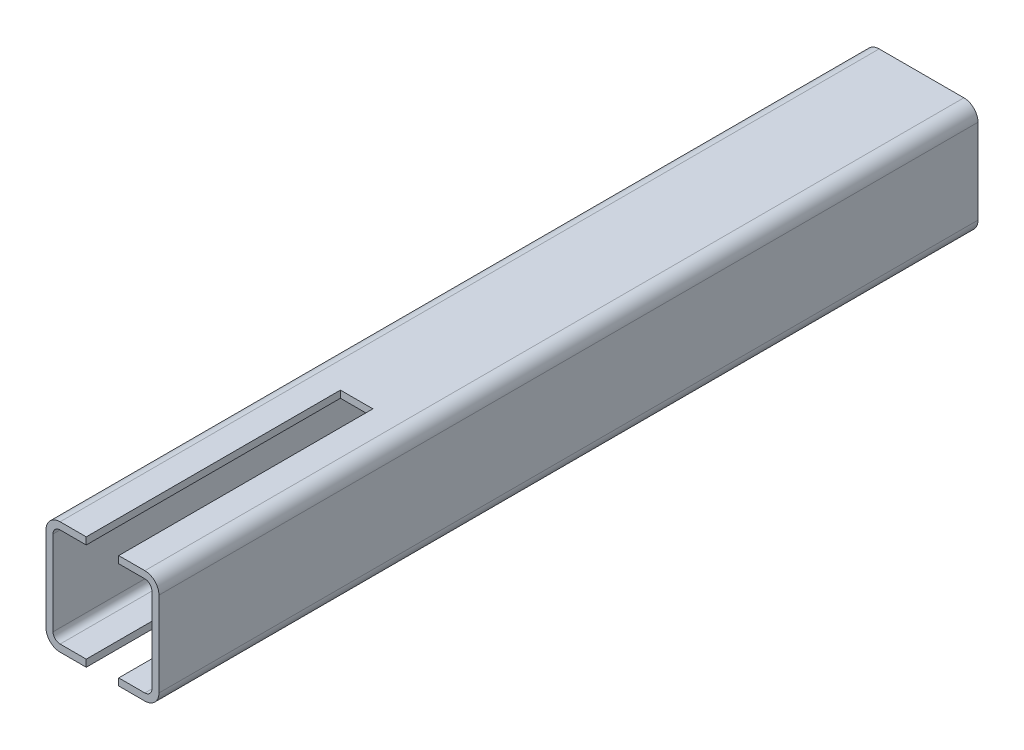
ISO-10303-21;
HEADER;
FILE_DESCRIPTION(('STEP AP214'),'2;1');
FILE_NAME('part.step','',(''),(''),'','','');
FILE_SCHEMA(('AUTOMOTIVE_DESIGN { 1 0 10303 214 1 1 1 1 }'));
ENDSEC;
DATA;
#1=APPLICATION_CONTEXT('core data for automotive mechanical design processes');
#2=APPLICATION_PROTOCOL_DEFINITION('international standard','automotive_design',2000,#1);
#3=PRODUCT_CONTEXT('',#1,'mechanical');
#4=PRODUCT('Part','Part','',(#3));
#5=PRODUCT_RELATED_PRODUCT_CATEGORY('part','',(#4));
#6=PRODUCT_DEFINITION_FORMATION('','',#4);
#7=PRODUCT_DEFINITION_CONTEXT('part definition',#1,'design');
#8=PRODUCT_DEFINITION('design','',#6,#7);
#9=PRODUCT_DEFINITION_SHAPE('','',#8);
#10=(LENGTH_UNIT() NAMED_UNIT(*) SI_UNIT(.MILLI.,.METRE.));
#11=(NAMED_UNIT(*) PLANE_ANGLE_UNIT() SI_UNIT($,.RADIAN.));
#12=(NAMED_UNIT(*) SI_UNIT($,.STERADIAN.) SOLID_ANGLE_UNIT());
#13=UNCERTAINTY_MEASURE_WITH_UNIT(LENGTH_MEASURE(1.E-05),#10,'distance_accuracy_value','');
#14=(GEOMETRIC_REPRESENTATION_CONTEXT(3) GLOBAL_UNCERTAINTY_ASSIGNED_CONTEXT((#13)) GLOBAL_UNIT_ASSIGNED_CONTEXT((#10,
#11,#12)) REPRESENTATION_CONTEXT('',''));
#15=CARTESIAN_POINT('',(0.,0.,0.));
#16=DIRECTION('',(0.,0.,1.));
#17=DIRECTION('',(1.,0.,0.));
#18=AXIS2_PLACEMENT_3D('',#15,#16,#17);
#19=CARTESIAN_POINT('',(-76.2,76.2,152.4));
#20=DIRECTION('',(0.,0.,1.));
#21=DIRECTION('',(1.,0.,0.));
#22=AXIS2_PLACEMENT_3D('',#19,#20,#21);
#23=PLANE('',#22);
#24=DIRECTION('',(0.,-1.,0.));
#25=VECTOR('',#24,1.);
#26=CARTESIAN_POINT('',(-29.21,76.2,152.4));
#27=LINE('',#26,#25);
#28=CARTESIAN_POINT('',(-29.21,101.6,152.4));
#29=VERTEX_POINT('',#28);
#30=CARTESIAN_POINT('',(-29.21,88.9,152.4));
#31=VERTEX_POINT('',#30);
#32=EDGE_CURVE('E54',#29,#31,#27,.T.);
#33=ORIENTED_EDGE('',*,*,#32,.F.);
#34=DIRECTION('',(-1.,0.,0.));
#35=VECTOR('',#34,1.);
#36=CARTESIAN_POINT('',(-76.2,101.6,152.4));
#37=LINE('',#36,#35);
#38=CARTESIAN_POINT('',(-76.2,101.6,152.4));
#39=VERTEX_POINT('',#38);
#40=EDGE_CURVE('E296',#29,#39,#37,.T.);
#41=ORIENTED_EDGE('',*,*,#40,.T.);
#42=CARTESIAN_POINT('',(-76.2,76.2,152.4));
#43=DIRECTION('',(0.,0.,1.));
#44=DIRECTION('',(1.,0.,0.));
#45=AXIS2_PLACEMENT_3D('',#42,#43,#44);
#46=CIRCLE('',#45,25.4);
#47=CARTESIAN_POINT('',(-101.6,76.2,152.4));
#48=VERTEX_POINT('',#47);
#49=EDGE_CURVE('E267',#39,#48,#46,.T.);
#50=ORIENTED_EDGE('',*,*,#49,.T.);
#51=DIRECTION('',(0.,-1.,0.));
#52=VECTOR('',#51,1.);
#53=CARTESIAN_POINT('',(-101.6,76.2,152.4));
#54=LINE('',#53,#52);
#55=CARTESIAN_POINT('',(-101.6,-76.2,152.4));
#56=VERTEX_POINT('',#55);
#57=EDGE_CURVE('E271',#48,#56,#54,.T.);
#58=ORIENTED_EDGE('',*,*,#57,.T.);
#59=CARTESIAN_POINT('',(-76.2,-76.2,152.4));
#60=DIRECTION('',(0.,0.,1.));
#61=DIRECTION('',(1.,0.,0.));
#62=AXIS2_PLACEMENT_3D('',#59,#60,#61);
#63=CIRCLE('',#62,25.4);
#64=CARTESIAN_POINT('',(-76.2,-101.6,152.4));
#65=VERTEX_POINT('',#64);
#66=EDGE_CURVE('E275',#56,#65,#63,.T.);
#67=ORIENTED_EDGE('',*,*,#66,.T.);
#68=DIRECTION('',(1.,0.,0.));
#69=VECTOR('',#68,1.);
#70=CARTESIAN_POINT('',(76.2,-101.6,152.4));
#71=LINE('',#70,#69);
#72=CARTESIAN_POINT('',(-29.21,-101.6,152.4));
#73=VERTEX_POINT('',#72);
#74=EDGE_CURVE('E280',#65,#73,#71,.T.);
#75=ORIENTED_EDGE('',*,*,#74,.T.);
#76=CARTESIAN_POINT('',(-29.21,-88.9,152.4));
#77=VERTEX_POINT('',#76);
#78=EDGE_CURVE('E214',#77,#73,#27,.T.);
#79=ORIENTED_EDGE('',*,*,#78,.F.);
#80=DIRECTION('',(1.,0.,0.));
#81=VECTOR('',#80,1.);
#82=CARTESIAN_POINT('',(76.2,-88.9,152.4));
#83=LINE('',#82,#81);
#84=CARTESIAN_POINT('',(-76.2,-88.9,152.4));
#85=VERTEX_POINT('',#84);
#86=EDGE_CURVE('E234',#85,#77,#83,.T.);
#87=ORIENTED_EDGE('',*,*,#86,.F.);
#88=CARTESIAN_POINT('',(-76.2,-76.2,152.4));
#89=DIRECTION('',(0.,0.,1.));
#90=DIRECTION('',(1.,0.,0.));
#91=AXIS2_PLACEMENT_3D('',#88,#89,#90);
#92=CIRCLE('',#91,12.7);
#93=CARTESIAN_POINT('',(-88.9,-76.2,152.4));
#94=VERTEX_POINT('',#93);
#95=EDGE_CURVE('E235',#94,#85,#92,.T.);
#96=ORIENTED_EDGE('',*,*,#95,.F.);
#97=DIRECTION('',(0.,-1.,0.));
#98=VECTOR('',#97,1.);
#99=CARTESIAN_POINT('',(-88.9000000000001,76.2,152.4));
#100=LINE('',#99,#98);
#101=CARTESIAN_POINT('',(-88.9000000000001,76.2,152.4));
#102=VERTEX_POINT('',#101);
#103=EDGE_CURVE('E263',#102,#94,#100,.T.);
#104=ORIENTED_EDGE('',*,*,#103,.F.);
#105=CARTESIAN_POINT('',(-76.2,76.2,152.4));
#106=DIRECTION('',(0.,0.,1.));
#107=DIRECTION('',(1.,0.,0.));
#108=AXIS2_PLACEMENT_3D('',#105,#106,#107);
#109=CIRCLE('',#108,12.7);
#110=CARTESIAN_POINT('',(-76.2,88.9,152.4));
#111=VERTEX_POINT('',#110);
#112=EDGE_CURVE('E259',#111,#102,#109,.T.);
#113=ORIENTED_EDGE('',*,*,#112,.F.);
#114=DIRECTION('',(-1.,0.,0.));
#115=VECTOR('',#114,1.);
#116=CARTESIAN_POINT('',(-76.2,88.9,152.4));
#117=LINE('',#116,#115);
#118=EDGE_CURVE('E254',#31,#111,#117,.T.);
#119=ORIENTED_EDGE('',*,*,#118,.F.);
#120=EDGE_LOOP('',(#33,#41,#50,#58,#67,#75,#79,#87,#96,#104,#113,#119));
#121=FACE_BOUND('',#120,.T.);
#122=ADVANCED_FACE('F45',(#121),#23,.T.);
#123=CARTESIAN_POINT('',(-76.2,76.2,-1320.8));
#124=DIRECTION('',(0.,0.,1.));
#125=DIRECTION('',(1.,0.,0.));
#126=AXIS2_PLACEMENT_3D('',#123,#124,#125);
#127=CYLINDRICAL_SURFACE('',#126,25.4);
#128=DIRECTION('',(0.,0.,1.));
#129=VECTOR('',#128,1.);
#130=CARTESIAN_POINT('',(-101.6,76.2,-1320.8));
#131=LINE('',#130,#129);
#132=CARTESIAN_POINT('',(-101.6,76.2,-1320.8));
#133=VERTEX_POINT('',#132);
#134=EDGE_CURVE('E390',#133,#48,#131,.T.);
#135=ORIENTED_EDGE('',*,*,#134,.T.);
#136=ORIENTED_EDGE('',*,*,#49,.F.);
#137=DIRECTION('',(0.,0.,1.));
#138=VECTOR('',#137,1.);
#139=CARTESIAN_POINT('',(-76.2,101.6,-1320.8));
#140=LINE('',#139,#138);
#141=CARTESIAN_POINT('',(-76.2,101.6,-1320.8));
#142=VERTEX_POINT('',#141);
#143=EDGE_CURVE('E391',#142,#39,#140,.T.);
#144=ORIENTED_EDGE('',*,*,#143,.F.);
#145=CARTESIAN_POINT('',(-76.2,76.2,-1320.8));
#146=DIRECTION('',(0.,0.,1.));
#147=DIRECTION('',(1.,0.,0.));
#148=AXIS2_PLACEMENT_3D('',#145,#146,#147);
#149=CIRCLE('',#148,25.4);
#150=EDGE_CURVE('E337',#142,#133,#149,.T.);
#151=ORIENTED_EDGE('',*,*,#150,.T.);
#152=EDGE_LOOP('',(#135,#136,#144,#151));
#153=FACE_BOUND('',#152,.T.);
#154=ADVANCED_FACE('F47',(#153),#127,.T.);
#155=CARTESIAN_POINT('',(-76.2,101.6,-1320.8));
#156=DIRECTION('',(0.,1.,0.));
#157=DIRECTION('',(0.,0.,1.));
#158=AXIS2_PLACEMENT_3D('',#155,#156,#157);
#159=PLANE('',#158);
#160=DIRECTION('',(0.,0.,1.));
#161=VECTOR('',#160,1.);
#162=CARTESIAN_POINT('',(-29.21,101.6,-1320.8));
#163=LINE('',#162,#161);
#164=CARTESIAN_POINT('',(-29.21,101.6,-304.8));
#165=VERTEX_POINT('',#164);
#166=EDGE_CURVE('E429',#165,#29,#163,.T.);
#167=ORIENTED_EDGE('',*,*,#166,.F.);
#168=DIRECTION('',(1.,0.,0.));
#169=VECTOR('',#168,1.);
#170=CARTESIAN_POINT('',(-76.2,101.6,-304.8));
#171=LINE('',#170,#169);
#172=CARTESIAN_POINT('',(29.21,101.6,-304.8));
#173=VERTEX_POINT('',#172);
#174=EDGE_CURVE('E240',#165,#173,#171,.T.);
#175=ORIENTED_EDGE('',*,*,#174,.T.);
#176=DIRECTION('',(0.,0.,-1.));
#177=VECTOR('',#176,1.);
#178=CARTESIAN_POINT('',(29.21,101.6,-1320.8));
#179=LINE('',#178,#177);
#180=CARTESIAN_POINT('',(29.21,101.6,152.4));
#181=VERTEX_POINT('',#180);
#182=EDGE_CURVE('E482',#181,#173,#179,.T.);
#183=ORIENTED_EDGE('',*,*,#182,.F.);
#184=CARTESIAN_POINT('',(76.2,101.6,152.4));
#185=VERTEX_POINT('',#184);
#186=EDGE_CURVE('E297',#185,#181,#37,.T.);
#187=ORIENTED_EDGE('',*,*,#186,.F.);
#188=DIRECTION('',(0.,0.,1.));
#189=VECTOR('',#188,1.);
#190=CARTESIAN_POINT('',(76.2,101.6,-1320.8));
#191=LINE('',#190,#189);
#192=CARTESIAN_POINT('',(76.2,101.6,-1320.8));
#193=VERTEX_POINT('',#192);
#194=EDGE_CURVE('E395',#193,#185,#191,.T.);
#195=ORIENTED_EDGE('',*,*,#194,.F.);
#196=DIRECTION('',(-1.,0.,0.));
#197=VECTOR('',#196,1.);
#198=CARTESIAN_POINT('',(-76.2,101.6,-1320.8));
#199=LINE('',#198,#197);
#200=EDGE_CURVE('E386',#193,#142,#199,.T.);
#201=ORIENTED_EDGE('',*,*,#200,.T.);
#202=ORIENTED_EDGE('',*,*,#143,.T.);
#203=ORIENTED_EDGE('',*,*,#40,.F.);
#204=EDGE_LOOP('',(#167,#175,#183,#187,#195,#201,#202,#203));
#205=FACE_BOUND('',#204,.T.);
#206=ADVANCED_FACE('F448',(#205),#159,.T.);
#207=CARTESIAN_POINT('',(76.2,76.2,-1320.8));
#208=DIRECTION('',(0.,0.,1.));
#209=DIRECTION('',(1.,0.,0.));
#210=AXIS2_PLACEMENT_3D('',#207,#208,#209);
#211=CYLINDRICAL_SURFACE('',#210,25.4);
#212=ORIENTED_EDGE('',*,*,#194,.T.);
#213=CARTESIAN_POINT('',(76.2,76.2,152.4));
#214=DIRECTION('',(0.,0.,1.));
#215=DIRECTION('',(1.,0.,0.));
#216=AXIS2_PLACEMENT_3D('',#213,#214,#215);
#217=CIRCLE('',#216,25.4);
#218=CARTESIAN_POINT('',(101.6,76.2,152.4));
#219=VERTEX_POINT('',#218);
#220=EDGE_CURVE('E292',#219,#185,#217,.T.);
#221=ORIENTED_EDGE('',*,*,#220,.F.);
#222=DIRECTION('',(0.,0.,1.));
#223=VECTOR('',#222,1.);
#224=CARTESIAN_POINT('',(101.6,76.2,-1320.8));
#225=LINE('',#224,#223);
#226=CARTESIAN_POINT('',(101.6,76.2,-1320.8));
#227=VERTEX_POINT('',#226);
#228=EDGE_CURVE('E398',#227,#219,#225,.T.);
#229=ORIENTED_EDGE('',*,*,#228,.F.);
#230=CARTESIAN_POINT('',(76.2,76.2,-1320.8));
#231=DIRECTION('',(0.,0.,1.));
#232=DIRECTION('',(1.,0.,0.));
#233=AXIS2_PLACEMENT_3D('',#230,#231,#232);
#234=CIRCLE('',#233,25.4);
#235=EDGE_CURVE('E382',#227,#193,#234,.T.);
#236=ORIENTED_EDGE('',*,*,#235,.T.);
#237=EDGE_LOOP('',(#212,#221,#229,#236));
#238=FACE_BOUND('',#237,.T.);
#239=ADVANCED_FACE('F478',(#238),#211,.T.);
#240=CARTESIAN_POINT('',(101.6,-76.2,-1320.8));
#241=DIRECTION('',(1.,0.,0.));
#242=DIRECTION('',(0.,0.,-1.));
#243=AXIS2_PLACEMENT_3D('',#240,#241,#242);
#244=PLANE('',#243);
#245=ORIENTED_EDGE('',*,*,#228,.T.);
#246=DIRECTION('',(0.,1.,0.));
#247=VECTOR('',#246,1.);
#248=CARTESIAN_POINT('',(101.6,-76.2,152.4));
#249=LINE('',#248,#247);
#250=CARTESIAN_POINT('',(101.6,-76.2,152.4));
#251=VERTEX_POINT('',#250);
#252=EDGE_CURVE('E288',#251,#219,#249,.T.);
#253=ORIENTED_EDGE('',*,*,#252,.F.);
#254=DIRECTION('',(0.,0.,1.));
#255=VECTOR('',#254,1.);
#256=CARTESIAN_POINT('',(101.6,-76.2,-1320.8));
#257=LINE('',#256,#255);
#258=CARTESIAN_POINT('',(101.6,-76.2,-1320.8));
#259=VERTEX_POINT('',#258);
#260=EDGE_CURVE('E401',#259,#251,#257,.T.);
#261=ORIENTED_EDGE('',*,*,#260,.F.);
#262=DIRECTION('',(0.,1.,0.));
#263=VECTOR('',#262,1.);
#264=CARTESIAN_POINT('',(101.6,-76.2,-1320.8));
#265=LINE('',#264,#263);
#266=EDGE_CURVE('E378',#259,#227,#265,.T.);
#267=ORIENTED_EDGE('',*,*,#266,.T.);
#268=EDGE_LOOP('',(#245,#253,#261,#267));
#269=FACE_BOUND('',#268,.T.);
#270=ADVANCED_FACE('F476',(#269),#244,.T.);
#271=CARTESIAN_POINT('',(76.2,-76.2,-1320.8));
#272=DIRECTION('',(0.,0.,1.));
#273=DIRECTION('',(1.,0.,0.));
#274=AXIS2_PLACEMENT_3D('',#271,#272,#273);
#275=CYLINDRICAL_SURFACE('',#274,25.4);
#276=ORIENTED_EDGE('',*,*,#260,.T.);
#277=CARTESIAN_POINT('',(76.2,-76.2,152.4));
#278=DIRECTION('',(0.,0.,1.));
#279=DIRECTION('',(1.,0.,0.));
#280=AXIS2_PLACEMENT_3D('',#277,#278,#279);
#281=CIRCLE('',#280,25.4);
#282=CARTESIAN_POINT('',(76.2,-101.6,152.4));
#283=VERTEX_POINT('',#282);
#284=EDGE_CURVE('E284',#283,#251,#281,.T.);
#285=ORIENTED_EDGE('',*,*,#284,.F.);
#286=DIRECTION('',(0.,0.,1.));
#287=VECTOR('',#286,1.);
#288=CARTESIAN_POINT('',(76.2,-101.6,-1320.8));
#289=LINE('',#288,#287);
#290=CARTESIAN_POINT('',(76.2,-101.6,-1320.8));
#291=VERTEX_POINT('',#290);
#292=EDGE_CURVE('E404',#291,#283,#289,.T.);
#293=ORIENTED_EDGE('',*,*,#292,.F.);
#294=CARTESIAN_POINT('',(76.2,-76.2,-1320.8));
#295=DIRECTION('',(0.,0.,1.));
#296=DIRECTION('',(1.,0.,0.));
#297=AXIS2_PLACEMENT_3D('',#294,#295,#296);
#298=CIRCLE('',#297,25.4);
#299=EDGE_CURVE('E374',#291,#259,#298,.T.);
#300=ORIENTED_EDGE('',*,*,#299,.T.);
#301=EDGE_LOOP('',(#276,#285,#293,#300));
#302=FACE_BOUND('',#301,.T.);
#303=ADVANCED_FACE('F470',(#302),#275,.T.);
#304=CARTESIAN_POINT('',(76.2,-101.6,-1320.8));
#305=DIRECTION('',(0.,-1.,0.));
#306=DIRECTION('',(0.,0.,-1.));
#307=AXIS2_PLACEMENT_3D('',#304,#305,#306);
#308=PLANE('',#307);
#309=DIRECTION('',(0.,0.,-1.));
#310=VECTOR('',#309,1.);
#311=CARTESIAN_POINT('',(-29.21,-101.6,-1320.8));
#312=LINE('',#311,#310);
#313=CARTESIAN_POINT('',(-29.21,-101.6,-304.8));
#314=VERTEX_POINT('',#313);
#315=EDGE_CURVE('E438',#73,#314,#312,.T.);
#316=ORIENTED_EDGE('',*,*,#315,.F.);
#317=ORIENTED_EDGE('',*,*,#74,.F.);
#318=DIRECTION('',(0.,0.,1.));
#319=VECTOR('',#318,1.);
#320=CARTESIAN_POINT('',(-76.2,-101.6,-1320.8));
#321=LINE('',#320,#319);
#322=CARTESIAN_POINT('',(-76.2,-101.6,-1320.8));
#323=VERTEX_POINT('',#322);
#324=EDGE_CURVE('E408',#323,#65,#321,.T.);
#325=ORIENTED_EDGE('',*,*,#324,.F.);
#326=DIRECTION('',(1.,0.,0.));
#327=VECTOR('',#326,1.);
#328=CARTESIAN_POINT('',(76.2,-101.6,-1320.8));
#329=LINE('',#328,#327);
#330=EDGE_CURVE('E370',#323,#291,#329,.T.);
#331=ORIENTED_EDGE('',*,*,#330,.T.);
#332=ORIENTED_EDGE('',*,*,#292,.T.);
#333=CARTESIAN_POINT('',(29.21,-101.6,152.4));
#334=VERTEX_POINT('',#333);
#335=EDGE_CURVE('E279',#334,#283,#71,.T.);
#336=ORIENTED_EDGE('',*,*,#335,.F.);
#337=DIRECTION('',(0.,0.,1.));
#338=VECTOR('',#337,1.);
#339=CARTESIAN_POINT('',(29.21,-101.6,-1320.8));
#340=LINE('',#339,#338);
#341=CARTESIAN_POINT('',(29.21,-101.6,-304.8));
#342=VERTEX_POINT('',#341);
#343=EDGE_CURVE('E69',#342,#334,#340,.T.);
#344=ORIENTED_EDGE('',*,*,#343,.F.);
#345=DIRECTION('',(-1.,0.,0.));
#346=VECTOR('',#345,1.);
#347=CARTESIAN_POINT('',(76.2,-101.6,-304.8));
#348=LINE('',#347,#346);
#349=EDGE_CURVE('E498',#342,#314,#348,.T.);
#350=ORIENTED_EDGE('',*,*,#349,.T.);
#351=EDGE_LOOP('',(#316,#317,#325,#331,#332,#336,#344,#350));
#352=FACE_BOUND('',#351,.T.);
#353=ADVANCED_FACE('F463',(#352),#308,.T.);
#354=CARTESIAN_POINT('',(-76.2,-76.2,-1320.8));
#355=DIRECTION('',(0.,0.,1.));
#356=DIRECTION('',(1.,0.,0.));
#357=AXIS2_PLACEMENT_3D('',#354,#355,#356);
#358=CYLINDRICAL_SURFACE('',#357,25.4);
#359=ORIENTED_EDGE('',*,*,#324,.T.);
#360=ORIENTED_EDGE('',*,*,#66,.F.);
#361=DIRECTION('',(0.,0.,1.));
#362=VECTOR('',#361,1.);
#363=CARTESIAN_POINT('',(-101.6,-76.2,-1320.8));
#364=LINE('',#363,#362);
#365=CARTESIAN_POINT('',(-101.6,-76.2,-1320.8));
#366=VERTEX_POINT('',#365);
#367=EDGE_CURVE('E411',#366,#56,#364,.T.);
#368=ORIENTED_EDGE('',*,*,#367,.F.);
#369=CARTESIAN_POINT('',(-76.2,-76.2,-1320.8));
#370=DIRECTION('',(0.,0.,1.));
#371=DIRECTION('',(1.,0.,0.));
#372=AXIS2_PLACEMENT_3D('',#369,#370,#371);
#373=CIRCLE('',#372,25.4);
#374=EDGE_CURVE('E366',#366,#323,#373,.T.);
#375=ORIENTED_EDGE('',*,*,#374,.T.);
#376=EDGE_LOOP('',(#359,#360,#368,#375));
#377=FACE_BOUND('',#376,.T.);
#378=ADVANCED_FACE('F459',(#377),#358,.T.);
#379=CARTESIAN_POINT('',(-101.6,76.2,-1320.8));
#380=DIRECTION('',(-1.,0.,0.));
#381=DIRECTION('',(0.,-1.,0.));
#382=AXIS2_PLACEMENT_3D('',#379,#380,#381);
#383=PLANE('',#382);
#384=ORIENTED_EDGE('',*,*,#367,.T.);
#385=ORIENTED_EDGE('',*,*,#57,.F.);
#386=ORIENTED_EDGE('',*,*,#134,.F.);
#387=DIRECTION('',(0.,-1.,0.));
#388=VECTOR('',#387,1.);
#389=CARTESIAN_POINT('',(-101.6,76.2,-1320.8));
#390=LINE('',#389,#388);
#391=EDGE_CURVE('E362',#133,#366,#390,.T.);
#392=ORIENTED_EDGE('',*,*,#391,.T.);
#393=EDGE_LOOP('',(#384,#385,#386,#392));
#394=FACE_BOUND('',#393,.T.);
#395=ADVANCED_FACE('F455',(#394),#383,.T.);
#396=CARTESIAN_POINT('',(-76.2,76.2,-1320.8));
#397=DIRECTION('',(0.,0.,1.));
#398=DIRECTION('',(1.,0.,0.));
#399=AXIS2_PLACEMENT_3D('',#396,#397,#398);
#400=PLANE('',#399);
#401=DIRECTION('',(0.,-1.,0.));
#402=VECTOR('',#401,1.);
#403=CARTESIAN_POINT('',(-88.9000000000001,76.2,-1320.8));
#404=LINE('',#403,#402);
#405=CARTESIAN_POINT('',(-88.9000000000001,76.2,-1320.8));
#406=VERTEX_POINT('',#405);
#407=CARTESIAN_POINT('',(-88.9,-76.2,-1320.8));
#408=VERTEX_POINT('',#407);
#409=EDGE_CURVE('E329',#406,#408,#404,.T.);
#410=ORIENTED_EDGE('',*,*,#409,.T.);
#411=CARTESIAN_POINT('',(-76.2,-76.2,-1320.8));
#412=DIRECTION('',(0.,0.,1.));
#413=DIRECTION('',(1.,0.,0.));
#414=AXIS2_PLACEMENT_3D('',#411,#412,#413);
#415=CIRCLE('',#414,12.7);
#416=CARTESIAN_POINT('',(-76.2,-88.9,-1320.8));
#417=VERTEX_POINT('',#416);
#418=EDGE_CURVE('E301',#408,#417,#415,.T.);
#419=ORIENTED_EDGE('',*,*,#418,.T.);
#420=DIRECTION('',(1.,0.,0.));
#421=VECTOR('',#420,1.);
#422=CARTESIAN_POINT('',(76.2,-88.9,-1320.8));
#423=LINE('',#422,#421);
#424=CARTESIAN_POINT('',(76.2,-88.9,-1320.8));
#425=VERTEX_POINT('',#424);
#426=EDGE_CURVE('E305',#417,#425,#423,.T.);
#427=ORIENTED_EDGE('',*,*,#426,.T.);
#428=CARTESIAN_POINT('',(76.2,-76.2,-1320.8));
#429=DIRECTION('',(0.,0.,1.));
#430=DIRECTION('',(1.,0.,0.));
#431=AXIS2_PLACEMENT_3D('',#428,#429,#430);
#432=CIRCLE('',#431,12.7);
#433=CARTESIAN_POINT('',(88.9,-76.2,-1320.8));
#434=VERTEX_POINT('',#433);
#435=EDGE_CURVE('E309',#425,#434,#432,.T.);
#436=ORIENTED_EDGE('',*,*,#435,.T.);
#437=DIRECTION('',(0.,1.,0.));
#438=VECTOR('',#437,1.);
#439=CARTESIAN_POINT('',(88.9,-76.2,-1320.8));
#440=LINE('',#439,#438);
#441=CARTESIAN_POINT('',(88.9,76.2,-1320.8));
#442=VERTEX_POINT('',#441);
#443=EDGE_CURVE('E313',#434,#442,#440,.T.);
#444=ORIENTED_EDGE('',*,*,#443,.T.);
#445=CARTESIAN_POINT('',(76.2,76.2,-1320.8));
#446=DIRECTION('',(0.,0.,1.));
#447=DIRECTION('',(1.,0.,0.));
#448=AXIS2_PLACEMENT_3D('',#445,#446,#447);
#449=CIRCLE('',#448,12.7);
#450=CARTESIAN_POINT('',(76.2,88.9,-1320.8));
#451=VERTEX_POINT('',#450);
#452=EDGE_CURVE('E317',#442,#451,#449,.T.);
#453=ORIENTED_EDGE('',*,*,#452,.T.);
#454=DIRECTION('',(-1.,0.,0.));
#455=VECTOR('',#454,1.);
#456=CARTESIAN_POINT('',(-76.2,88.9,-1320.8));
#457=LINE('',#456,#455);
#458=CARTESIAN_POINT('',(-76.2,88.9,-1320.8));
#459=VERTEX_POINT('',#458);
#460=EDGE_CURVE('E321',#451,#459,#457,.T.);
#461=ORIENTED_EDGE('',*,*,#460,.T.);
#462=CARTESIAN_POINT('',(-76.2,76.2,-1320.8));
#463=DIRECTION('',(0.,0.,1.));
#464=DIRECTION('',(1.,0.,0.));
#465=AXIS2_PLACEMENT_3D('',#462,#463,#464);
#466=CIRCLE('',#465,12.7);
#467=EDGE_CURVE('E325',#459,#406,#466,.T.);
#468=ORIENTED_EDGE('',*,*,#467,.T.);
#469=EDGE_LOOP('',(#410,#419,#427,#436,#444,#453,#461,#468));
#470=FACE_BOUND('',#469,.T.);
#471=ORIENTED_EDGE('',*,*,#150,.F.);
#472=ORIENTED_EDGE('',*,*,#200,.F.);
#473=ORIENTED_EDGE('',*,*,#235,.F.);
#474=ORIENTED_EDGE('',*,*,#266,.F.);
#475=ORIENTED_EDGE('',*,*,#299,.F.);
#476=ORIENTED_EDGE('',*,*,#330,.F.);
#477=ORIENTED_EDGE('',*,*,#374,.F.);
#478=ORIENTED_EDGE('',*,*,#391,.F.);
#479=EDGE_LOOP('',(#471,#472,#473,#474,#475,#476,#477,#478));
#480=FACE_BOUND('',#479,.T.);
#481=ADVANCED_FACE('F466',(#470,#480),#400,.F.);
#482=CARTESIAN_POINT('',(-76.2,-76.2,-1320.8));
#483=DIRECTION('',(0.,0.,1.));
#484=DIRECTION('',(1.,0.,0.));
#485=AXIS2_PLACEMENT_3D('',#482,#483,#484);
#486=CYLINDRICAL_SURFACE('',#485,12.7);
#487=DIRECTION('',(0.,0.,1.));
#488=VECTOR('',#487,1.);
#489=CARTESIAN_POINT('',(-88.9,-76.2,-1320.8));
#490=LINE('',#489,#488);
#491=EDGE_CURVE('E334',#408,#94,#490,.T.);
#492=ORIENTED_EDGE('',*,*,#491,.T.);
#493=ORIENTED_EDGE('',*,*,#95,.T.);
#494=DIRECTION('',(0.,0.,1.));
#495=VECTOR('',#494,1.);
#496=CARTESIAN_POINT('',(-76.2,-88.9,-1320.8));
#497=LINE('',#496,#495);
#498=EDGE_CURVE('E333',#417,#85,#497,.T.);
#499=ORIENTED_EDGE('',*,*,#498,.F.);
#500=ORIENTED_EDGE('',*,*,#418,.F.);
#501=EDGE_LOOP('',(#492,#493,#499,#500));
#502=FACE_BOUND('',#501,.T.);
#503=ADVANCED_FACE('F540',(#502),#486,.F.);
#504=CARTESIAN_POINT('',(-88.9000000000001,76.2,-1320.8));
#505=DIRECTION('',(-1.,0.,0.));
#506=DIRECTION('',(0.,-1.,0.));
#507=AXIS2_PLACEMENT_3D('',#504,#505,#506);
#508=PLANE('',#507);
#509=DIRECTION('',(0.,0.,1.));
#510=VECTOR('',#509,1.);
#511=CARTESIAN_POINT('',(-88.9000000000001,76.2,-1320.8));
#512=LINE('',#511,#510);
#513=EDGE_CURVE('E338',#406,#102,#512,.T.);
#514=ORIENTED_EDGE('',*,*,#513,.T.);
#515=ORIENTED_EDGE('',*,*,#103,.T.);
#516=ORIENTED_EDGE('',*,*,#491,.F.);
#517=ORIENTED_EDGE('',*,*,#409,.F.);
#518=EDGE_LOOP('',(#514,#515,#516,#517));
#519=FACE_BOUND('',#518,.T.);
#520=ADVANCED_FACE('F536',(#519),#508,.F.);
#521=CARTESIAN_POINT('',(-76.2,76.2,-1320.8));
#522=DIRECTION('',(0.,0.,1.));
#523=DIRECTION('',(1.,0.,0.));
#524=AXIS2_PLACEMENT_3D('',#521,#522,#523);
#525=CYLINDRICAL_SURFACE('',#524,12.7);
#526=DIRECTION('',(0.,0.,1.));
#527=VECTOR('',#526,1.);
#528=CARTESIAN_POINT('',(-76.2,88.9,-1320.8));
#529=LINE('',#528,#527);
#530=EDGE_CURVE('E341',#459,#111,#529,.T.);
#531=ORIENTED_EDGE('',*,*,#530,.T.);
#532=ORIENTED_EDGE('',*,*,#112,.T.);
#533=ORIENTED_EDGE('',*,*,#513,.F.);
#534=ORIENTED_EDGE('',*,*,#467,.F.);
#535=EDGE_LOOP('',(#531,#532,#533,#534));
#536=FACE_BOUND('',#535,.T.);
#537=ADVANCED_FACE('F539',(#536),#525,.F.);
#538=CARTESIAN_POINT('',(-76.2,88.9,-1320.8));
#539=DIRECTION('',(0.,1.,0.));
#540=DIRECTION('',(0.,0.,1.));
#541=AXIS2_PLACEMENT_3D('',#538,#539,#540);
#542=PLANE('',#541);
#543=DIRECTION('',(1.,0.,0.));
#544=VECTOR('',#543,1.);
#545=CARTESIAN_POINT('',(-76.2,88.9,-304.8));
#546=LINE('',#545,#544);
#547=CARTESIAN_POINT('',(-29.21,88.9,-304.8));
#548=VERTEX_POINT('',#547);
#549=CARTESIAN_POINT('',(29.21,88.9,-304.8));
#550=VERTEX_POINT('',#549);
#551=EDGE_CURVE('E436',#548,#550,#546,.T.);
#552=ORIENTED_EDGE('',*,*,#551,.F.);
#553=DIRECTION('',(0.,0.,1.));
#554=VECTOR('',#553,1.);
#555=CARTESIAN_POINT('',(-29.21,88.9,-1320.8));
#556=LINE('',#555,#554);
#557=EDGE_CURVE('E426',#548,#31,#556,.T.);
#558=ORIENTED_EDGE('',*,*,#557,.T.);
#559=ORIENTED_EDGE('',*,*,#118,.T.);
#560=ORIENTED_EDGE('',*,*,#530,.F.);
#561=ORIENTED_EDGE('',*,*,#460,.F.);
#562=DIRECTION('',(0.,0.,1.));
#563=VECTOR('',#562,1.);
#564=CARTESIAN_POINT('',(76.2,88.9,-1320.8));
#565=LINE('',#564,#563);
#566=CARTESIAN_POINT('',(76.2,88.9,152.4));
#567=VERTEX_POINT('',#566);
#568=EDGE_CURVE('E345',#451,#567,#565,.T.);
#569=ORIENTED_EDGE('',*,*,#568,.T.);
#570=CARTESIAN_POINT('',(29.21,88.9,152.4));
#571=VERTEX_POINT('',#570);
#572=EDGE_CURVE('E255',#567,#571,#117,.T.);
#573=ORIENTED_EDGE('',*,*,#572,.T.);
#574=DIRECTION('',(0.,0.,-1.));
#575=VECTOR('',#574,1.);
#576=CARTESIAN_POINT('',(29.21,88.9,-1320.8));
#577=LINE('',#576,#575);
#578=EDGE_CURVE('E61',#571,#550,#577,.T.);
#579=ORIENTED_EDGE('',*,*,#578,.T.);
#580=EDGE_LOOP('',(#552,#558,#559,#560,#561,#569,#573,#579));
#581=FACE_BOUND('',#580,.T.);
#582=ADVANCED_FACE('F435',(#581),#542,.F.);
#583=CARTESIAN_POINT('',(76.2,76.2,-1320.8));
#584=DIRECTION('',(0.,0.,1.));
#585=DIRECTION('',(1.,0.,0.));
#586=AXIS2_PLACEMENT_3D('',#583,#584,#585);
#587=CYLINDRICAL_SURFACE('',#586,12.7);
#588=DIRECTION('',(0.,0.,1.));
#589=VECTOR('',#588,1.);
#590=CARTESIAN_POINT('',(88.9,76.2,-1320.8));
#591=LINE('',#590,#589);
#592=CARTESIAN_POINT('',(88.9,76.2,152.4));
#593=VERTEX_POINT('',#592);
#594=EDGE_CURVE('E348',#442,#593,#591,.T.);
#595=ORIENTED_EDGE('',*,*,#594,.T.);
#596=CARTESIAN_POINT('',(76.2,76.2,152.4));
#597=DIRECTION('',(0.,0.,1.));
#598=DIRECTION('',(1.,0.,0.));
#599=AXIS2_PLACEMENT_3D('',#596,#597,#598);
#600=CIRCLE('',#599,12.7);
#601=EDGE_CURVE('E250',#593,#567,#600,.T.);
#602=ORIENTED_EDGE('',*,*,#601,.T.);
#603=ORIENTED_EDGE('',*,*,#568,.F.);
#604=ORIENTED_EDGE('',*,*,#452,.F.);
#605=EDGE_LOOP('',(#595,#602,#603,#604));
#606=FACE_BOUND('',#605,.T.);
#607=ADVANCED_FACE('F547',(#606),#587,.F.);
#608=CARTESIAN_POINT('',(88.9,-76.2,-1320.8));
#609=DIRECTION('',(1.,0.,0.));
#610=DIRECTION('',(0.,0.,-1.));
#611=AXIS2_PLACEMENT_3D('',#608,#609,#610);
#612=PLANE('',#611);
#613=DIRECTION('',(0.,0.,1.));
#614=VECTOR('',#613,1.);
#615=CARTESIAN_POINT('',(88.9,-76.2,-1320.8));
#616=LINE('',#615,#614);
#617=CARTESIAN_POINT('',(88.9,-76.2,152.4));
#618=VERTEX_POINT('',#617);
#619=EDGE_CURVE('E351',#434,#618,#616,.T.);
#620=ORIENTED_EDGE('',*,*,#619,.T.);
#621=DIRECTION('',(0.,1.,0.));
#622=VECTOR('',#621,1.);
#623=CARTESIAN_POINT('',(88.9,-76.2,152.4));
#624=LINE('',#623,#622);
#625=EDGE_CURVE('E246',#618,#593,#624,.T.);
#626=ORIENTED_EDGE('',*,*,#625,.T.);
#627=ORIENTED_EDGE('',*,*,#594,.F.);
#628=ORIENTED_EDGE('',*,*,#443,.F.);
#629=EDGE_LOOP('',(#620,#626,#627,#628));
#630=FACE_BOUND('',#629,.T.);
#631=ADVANCED_FACE('F550',(#630),#612,.F.);
#632=CARTESIAN_POINT('',(76.2,-76.2,-1320.8));
#633=DIRECTION('',(0.,0.,1.));
#634=DIRECTION('',(1.,0.,0.));
#635=AXIS2_PLACEMENT_3D('',#632,#633,#634);
#636=CYLINDRICAL_SURFACE('',#635,12.7);
#637=DIRECTION('',(0.,0.,1.));
#638=VECTOR('',#637,1.);
#639=CARTESIAN_POINT('',(76.2,-88.9,-1320.8));
#640=LINE('',#639,#638);
#641=CARTESIAN_POINT('',(76.2,-88.9,152.4));
#642=VERTEX_POINT('',#641);
#643=EDGE_CURVE('E354',#425,#642,#640,.T.);
#644=ORIENTED_EDGE('',*,*,#643,.T.);
#645=CARTESIAN_POINT('',(76.2,-76.2,152.4));
#646=DIRECTION('',(0.,0.,1.));
#647=DIRECTION('',(1.,0.,0.));
#648=AXIS2_PLACEMENT_3D('',#645,#646,#647);
#649=CIRCLE('',#648,12.7);
#650=EDGE_CURVE('E232',#642,#618,#649,.T.);
#651=ORIENTED_EDGE('',*,*,#650,.T.);
#652=ORIENTED_EDGE('',*,*,#619,.F.);
#653=ORIENTED_EDGE('',*,*,#435,.F.);
#654=EDGE_LOOP('',(#644,#651,#652,#653));
#655=FACE_BOUND('',#654,.T.);
#656=ADVANCED_FACE('F554',(#655),#636,.F.);
#657=CARTESIAN_POINT('',(76.2,-88.9,-1320.8));
#658=DIRECTION('',(0.,-1.,0.));
#659=DIRECTION('',(0.,0.,-1.));
#660=AXIS2_PLACEMENT_3D('',#657,#658,#659);
#661=PLANE('',#660);
#662=ORIENTED_EDGE('',*,*,#86,.T.);
#663=DIRECTION('',(0.,0.,-1.));
#664=VECTOR('',#663,1.);
#665=CARTESIAN_POINT('',(-29.21,-88.9,-1320.8));
#666=LINE('',#665,#664);
#667=CARTESIAN_POINT('',(-29.21,-88.9,-304.8));
#668=VERTEX_POINT('',#667);
#669=EDGE_CURVE('E439',#77,#668,#666,.T.);
#670=ORIENTED_EDGE('',*,*,#669,.T.);
#671=DIRECTION('',(-1.,0.,0.));
#672=VECTOR('',#671,1.);
#673=CARTESIAN_POINT('',(76.2,-88.9,-304.8));
#674=LINE('',#673,#672);
#675=CARTESIAN_POINT('',(29.21,-88.9,-304.8));
#676=VERTEX_POINT('',#675);
#677=EDGE_CURVE('E11',#676,#668,#674,.T.);
#678=ORIENTED_EDGE('',*,*,#677,.F.);
#679=DIRECTION('',(0.,0.,1.));
#680=VECTOR('',#679,1.);
#681=CARTESIAN_POINT('',(29.21,-88.9,-1320.8));
#682=LINE('',#681,#680);
#683=CARTESIAN_POINT('',(29.21,-88.9,152.4));
#684=VERTEX_POINT('',#683);
#685=EDGE_CURVE('E208',#676,#684,#682,.T.);
#686=ORIENTED_EDGE('',*,*,#685,.T.);
#687=EDGE_CURVE('E222',#684,#642,#83,.T.);
#688=ORIENTED_EDGE('',*,*,#687,.T.);
#689=ORIENTED_EDGE('',*,*,#643,.F.);
#690=ORIENTED_EDGE('',*,*,#426,.F.);
#691=ORIENTED_EDGE('',*,*,#498,.T.);
#692=EDGE_LOOP('',(#662,#670,#678,#686,#688,#689,#690,#691));
#693=FACE_BOUND('',#692,.T.);
#694=ADVANCED_FACE('F220',(#693),#661,.F.);
#695=DIRECTION('',(0.,1.,0.));
#696=VECTOR('',#695,1.);
#697=CARTESIAN_POINT('',(29.21,76.2,152.4));
#698=LINE('',#697,#696);
#699=EDGE_CURVE('E205',#334,#684,#698,.T.);
#700=ORIENTED_EDGE('',*,*,#699,.F.);
#701=ORIENTED_EDGE('',*,*,#335,.T.);
#702=ORIENTED_EDGE('',*,*,#284,.T.);
#703=ORIENTED_EDGE('',*,*,#252,.T.);
#704=ORIENTED_EDGE('',*,*,#220,.T.);
#705=ORIENTED_EDGE('',*,*,#186,.T.);
#706=EDGE_CURVE('E215',#571,#181,#698,.T.);
#707=ORIENTED_EDGE('',*,*,#706,.F.);
#708=ORIENTED_EDGE('',*,*,#572,.F.);
#709=ORIENTED_EDGE('',*,*,#601,.F.);
#710=ORIENTED_EDGE('',*,*,#625,.F.);
#711=ORIENTED_EDGE('',*,*,#650,.F.);
#712=ORIENTED_EDGE('',*,*,#687,.F.);
#713=EDGE_LOOP('',(#700,#701,#702,#703,#704,#705,#707,#708,#709,#710,#711,#712));
#714=FACE_BOUND('',#713,.T.);
#715=ADVANCED_FACE('F229',(#714),#23,.T.);
#716=CARTESIAN_POINT('',(29.21,160.402037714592,-304.8));
#717=DIRECTION('',(1.,0.,0.));
#718=DIRECTION('',(0.,1.,0.));
#719=AXIS2_PLACEMENT_3D('',#716,#717,#718);
#720=PLANE('',#719);
#721=ORIENTED_EDGE('',*,*,#182,.T.);
#722=DIRECTION('',(0.,1.,0.));
#723=VECTOR('',#722,1.);
#724=CARTESIAN_POINT('',(29.21,160.402037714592,-304.8));
#725=LINE('',#724,#723);
#726=EDGE_CURVE('E507',#550,#173,#725,.T.);
#727=ORIENTED_EDGE('',*,*,#726,.F.);
#728=ORIENTED_EDGE('',*,*,#578,.F.);
#729=ORIENTED_EDGE('',*,*,#706,.T.);
#730=EDGE_LOOP('',(#721,#727,#728,#729));
#731=FACE_BOUND('',#730,.T.);
#732=ADVANCED_FACE('F516',(#731),#720,.F.);
#733=CARTESIAN_POINT('',(-29.21,160.402037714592,-304.8));
#734=DIRECTION('',(-1.,0.,0.));
#735=DIRECTION('',(0.,-1.,0.));
#736=AXIS2_PLACEMENT_3D('',#733,#734,#735);
#737=PLANE('',#736);
#738=ORIENTED_EDGE('',*,*,#166,.T.);
#739=ORIENTED_EDGE('',*,*,#32,.T.);
#740=ORIENTED_EDGE('',*,*,#557,.F.);
#741=DIRECTION('',(0.,-1.,0.));
#742=VECTOR('',#741,1.);
#743=CARTESIAN_POINT('',(-29.21,160.402037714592,-304.8));
#744=LINE('',#743,#742);
#745=EDGE_CURVE('E510',#165,#548,#744,.T.);
#746=ORIENTED_EDGE('',*,*,#745,.F.);
#747=EDGE_LOOP('',(#738,#739,#740,#746));
#748=FACE_BOUND('',#747,.T.);
#749=ADVANCED_FACE('F424',(#748),#737,.F.);
#750=CARTESIAN_POINT('',(0.,0.,-304.8));
#751=DIRECTION('',(0.,0.,1.));
#752=DIRECTION('',(1.,0.,0.));
#753=AXIS2_PLACEMENT_3D('',#750,#751,#752);
#754=PLANE('',#753);
#755=ORIENTED_EDGE('',*,*,#745,.T.);
#756=ORIENTED_EDGE('',*,*,#551,.T.);
#757=ORIENTED_EDGE('',*,*,#726,.T.);
#758=ORIENTED_EDGE('',*,*,#174,.F.);
#759=EDGE_LOOP('',(#755,#756,#757,#758));
#760=FACE_BOUND('',#759,.T.);
#761=ADVANCED_FACE('F523',(#760),#754,.T.);
#762=EDGE_CURVE('E226',#342,#676,#725,.T.);
#763=ORIENTED_EDGE('',*,*,#762,.T.);
#764=ORIENTED_EDGE('',*,*,#677,.T.);
#765=EDGE_CURVE('E505',#668,#314,#744,.T.);
#766=ORIENTED_EDGE('',*,*,#765,.T.);
#767=ORIENTED_EDGE('',*,*,#349,.F.);
#768=EDGE_LOOP('',(#763,#764,#766,#767));
#769=FACE_BOUND('',#768,.T.);
#770=ADVANCED_FACE('F503',(#769),#754,.T.);
#771=ORIENTED_EDGE('',*,*,#315,.T.);
#772=ORIENTED_EDGE('',*,*,#765,.F.);
#773=ORIENTED_EDGE('',*,*,#669,.F.);
#774=ORIENTED_EDGE('',*,*,#78,.T.);
#775=EDGE_LOOP('',(#771,#772,#773,#774));
#776=FACE_BOUND('',#775,.T.);
#777=ADVANCED_FACE('F525',(#776),#737,.F.);
#778=ORIENTED_EDGE('',*,*,#343,.T.);
#779=ORIENTED_EDGE('',*,*,#699,.T.);
#780=ORIENTED_EDGE('',*,*,#685,.F.);
#781=ORIENTED_EDGE('',*,*,#762,.F.);
#782=EDGE_LOOP('',(#778,#779,#780,#781));
#783=FACE_BOUND('',#782,.T.);
#784=ADVANCED_FACE('F207',(#783),#720,.F.);
#785=CLOSED_SHELL('',(#122,#154,#206,#239,#270,#303,#353,#378,#395,#481,#503,#520,#537,#582,
#607,#631,#656,#694,#715,#732,#749,#761,#770,#777,#784));
#786=MANIFOLD_SOLID_BREP('B2',#785);
#787=ADVANCED_BREP_SHAPE_REPRESENTATION('',(#18,#786),#14);
#788=SHAPE_DEFINITION_REPRESENTATION(#9,#787);
ENDSEC;
END-ISO-10303-21;
